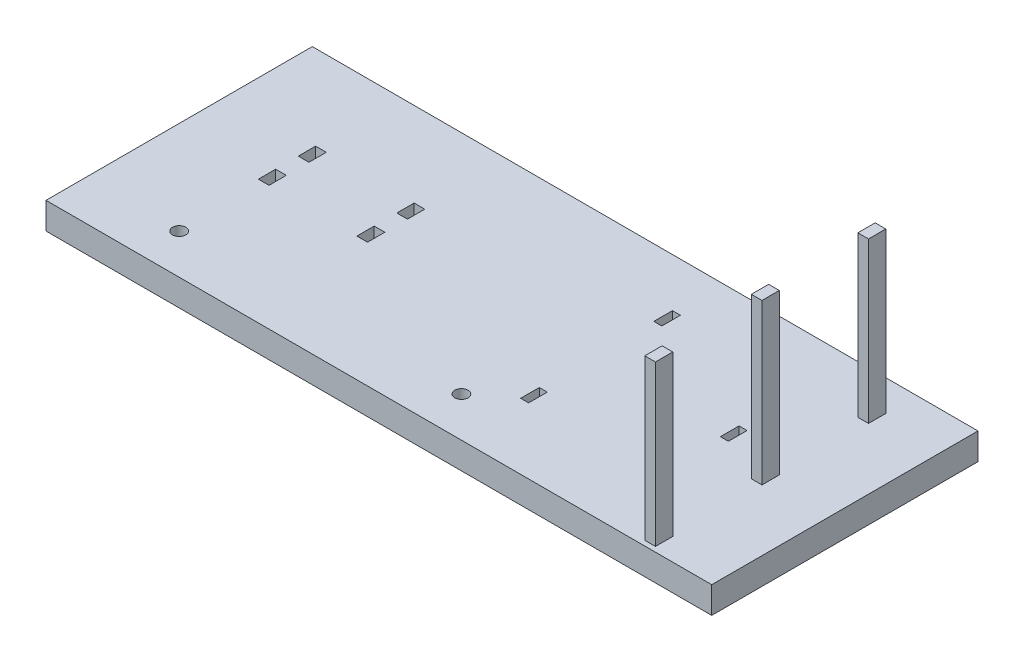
from build123d import *

# Parameters (mm, degrees)
SKETCH1_W           = 25
SKETCH1_H           = 10
BOSS_EXTRUDE1_DEPTH = 1
SKETCH2_R           = 0.25
SKETCH2_W           = 0.4
SKETCH2_H           = 0.65
SKETCH2_W_2         = 0.3
SKETCH2_H_2         = 0.7
CUT_EXTRUDE1_DEPTH  = 1
SKETCH3_W           = 0.4
SKETCH3_H           = 0.65
BOSS_EXTRUDE2_DEPTH = 6


with BuildPart() as part:
    # Sketch1 → Boss-Extrude1 (new body)
    with BuildSketch(Plane(origin=(0, 0, 0), x_dir=(1, 0, 0), z_dir=(0, 1, 0))):
        Rectangle(SKETCH1_W, SKETCH1_H)
    extrude(amount=BOSS_EXTRUDE1_DEPTH)

    # Sketch2 → Cut-Extrude1 (cut)
    with BuildSketch(Plane.XZ):
        with Locations(Location((-9, 3.5, 0), (0, 0, 270))):
            Circle(SKETCH2_R)
        with Locations(Location((1.6, 3.5, 0), (0, 0, 270))):
            Circle(SKETCH2_R)
        with Locations((-9, 0)):
            Rectangle(SKETCH2_W, SKETCH2_H)
        with Locations((-9, -1.5)):
            Rectangle(SKETCH2_W, SKETCH2_H)
        with Locations((-5.3, 0)):
            Rectangle(SKETCH2_W, SKETCH2_H)
        with Locations((-5.3, -1.5)):
            Rectangle(SKETCH2_W, SKETCH2_H)
        with Locations((8, -0.325)):
            Rectangle(SKETCH2_W_2, SKETCH2_H_2)
        with Locations((3, 2.175)):
            Rectangle(SKETCH2_W_2, SKETCH2_H_2)
        with Locations((3, -2.825)):
            Rectangle(SKETCH2_W_2, SKETCH2_H_2)
    extrude(amount=-CUT_EXTRUDE1_DEPTH, mode=Mode.SUBTRACT)

    # Sketch3 → Boss-Extrude2 (add)
    with BuildSketch(Plane(origin=(0, 1, 0), x_dir=(1, 0, 0), z_dir=(0, 1, 0))):
        with Locations((10, -0.487564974)):
            Rectangle(SKETCH3_W, SKETCH3_H)
        with Locations((10, 3.512435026)):
            Rectangle(SKETCH3_W, SKETCH3_H)
        with Locations((10, -4.487564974)):
            Rectangle(SKETCH3_W, SKETCH3_H)
    extrude(amount=BOSS_EXTRUDE2_DEPTH)


solid = part.part
